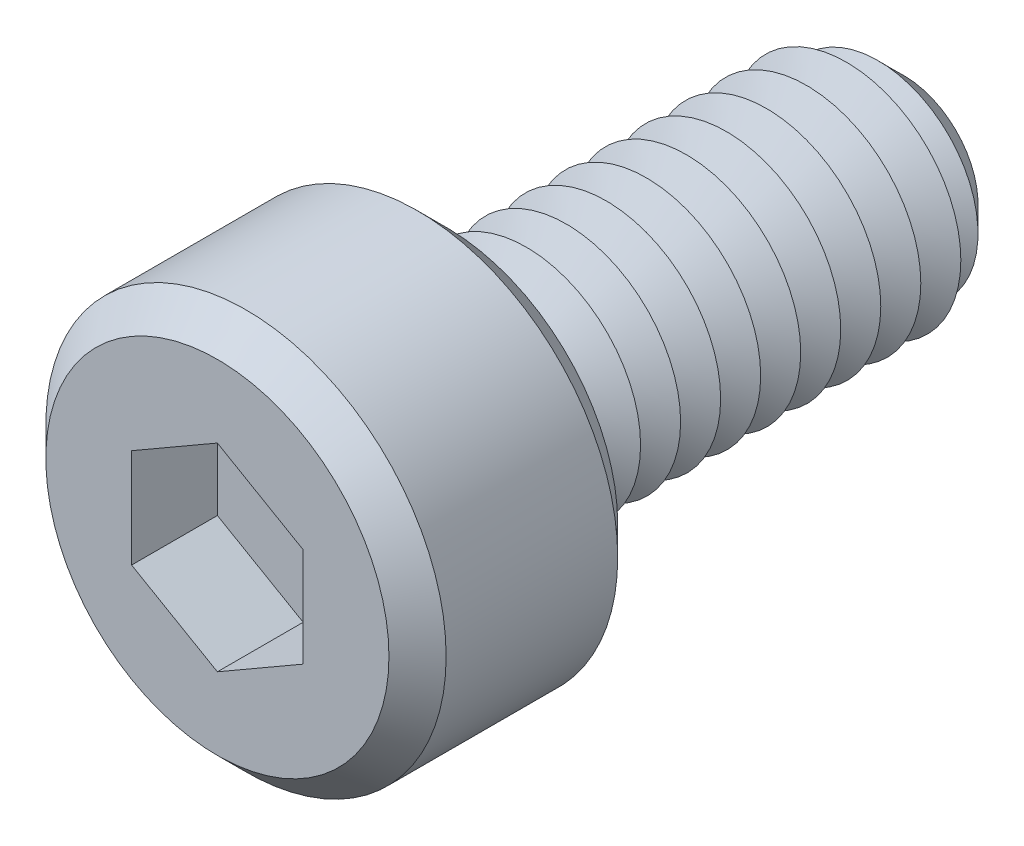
from build123d import *

# Parameters (mm, degrees)
SKETCH1_R           = 3.5
BOSS_EXTRUDE1_DEPTH = 4
SKETCH2_R           = 2
BOSS_EXTRUDE2_DEPTH = 8
CHAMFER1_SIZE       = 0.7
LPATTERN1_COUNT     = 11
LPATTERN1_PITCH     = 0.7
CUT_EXTRUDE1_DEPTH  = 1.5
SKETCH6_R           = 0.5
CUT_EXTRUDE2_DEPTH  = 10.5
CHAMFER2_SIZE       = 0.5


with BuildPart() as part:
    # Sketch1 → Boss-Extrude1 (new body)
    with BuildSketch(Plane.XY):
        Circle(SKETCH1_R)
    extrude(amount=BOSS_EXTRUDE1_DEPTH)

    # Sketch2 → Boss-Extrude2 (add)
    with BuildSketch(Plane(origin=(0, 0, 0), x_dir=(-1, 0, 0), z_dir=(0, 0, -1))):
        Circle(SKETCH2_R)
    extrude(amount=BOSS_EXTRUDE2_DEPTH)

    # Chamfer1
    chamfer1_edges = [part.edges().sort_by_distance(p)[0] for p in [
        (2, 0, -8),
    ]]
    chamfer(chamfer1_edges, length=CHAMFER1_SIZE)

    # Sketch4 → Cut-Revolve1 (revolve, cut)
    with BuildSketch(Plane(origin=(0, 0, 0), x_dir=(0, 0, -1), z_dir=(1, 0, 0)), mode=Mode.PRIVATE) as cut_revolve1_sk:
        Polygon((0, 2), (0.35, 1.393782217), (0.7, 2), align=None)
    cut_revolve1 = revolve(cut_revolve1_sk.sketch.rotate(Axis((0, 0, 2.512122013), (0, 0, -1)), 90), axis=Axis((0, 0, 2.512122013), (0, 0, -1)), mode=Mode.SUBTRACT)

    # LPattern1: Cut-Revolve1 ×11
    with Locations(*[(0, 0, -i * LPATTERN1_PITCH) for i in range(1, LPATTERN1_COUNT)]):
        add(cut_revolve1, mode=Mode.SUBTRACT)

    # Sketch5 → Cut-Extrude1 (cut)
    with BuildSketch(Plane.XY.offset(4)):
        Polygon((0, 1.732050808), (-1.5, 0.866025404), (-1.5, -0.866025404), (0, -1.732050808), (1.5, -0.866025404), (1.5, 0.866025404), align=None)
    extrude(amount=-CUT_EXTRUDE1_DEPTH, mode=Mode.SUBTRACT)

    # Sketch6 → Cut-Extrude2 (cut)
    with BuildSketch(Plane.XY.offset(2.5)):
        Circle(SKETCH6_R)
    extrude(amount=-CUT_EXTRUDE2_DEPTH, mode=Mode.SUBTRACT)

    # Chamfer2
    chamfer2_edges = [part.edges().sort_by_distance(p)[0] for p in [
        (-3.5, 0, 0),
        (-3.5, 0, 4),
    ]]
    chamfer(chamfer2_edges, length=CHAMFER2_SIZE)


solid = part.part
